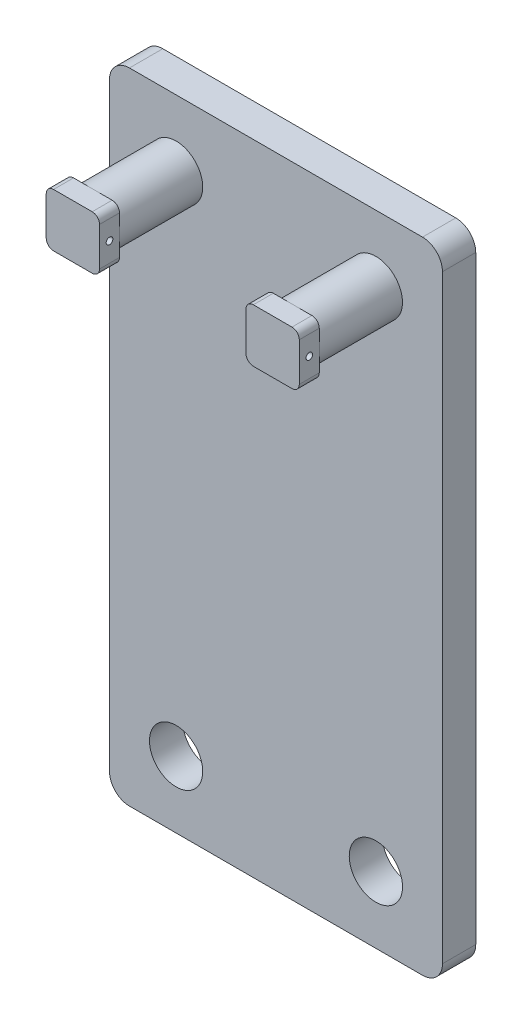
from build123d import *

# Parameters (mm, degrees)
BOSS_EXTRUDE1_DEPTH = 50
FILLET1_R           = 30
FILLET2_R           = 30
FILLET3_R           = 30
FILLET4_R           = 30
SKETCH6_R           = 40
CUT_EXTRUDE3_DEPTH  = 75
SKETCH7_R           = 40
BOSS_EXTRUDE4_DEPTH = 125
SKETCH8_W           = 80
SKETCH8_H           = 80
BOSS_EXTRUDE5_DEPTH = 30
SKETCH9_R           = 5
CUT_EXTRUDE4_DEPTH  = 80
FILLET13_R          = 11
FILLET14_R          = 11
FILLET15_R          = 11
FILLET16_R          = 11
FILLET17_R          = 11
FILLET18_R          = 11
FILLET19_R          = 11
FILLET20_R          = 11


with BuildPart() as part:
    # Sketch1 → Boss-Extrude1 (new body)
    with BuildSketch(Plane.XY):
        Polygon((250, 55.311649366), (-250, 55.311649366), (-250, -44.688350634), (-250, -264.688350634), (-250, -584.688350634), (-250, -804.688350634), (-250, -904.688350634), (250, -904.688350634), (250, -804.688350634), (250, -584.688350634), (250, -264.688350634), (250, -44.688350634), align=None)
    extrude(amount=BOSS_EXTRUDE1_DEPTH)

    # Fillet1
    fillet1_edges = [part.edges().sort_by_distance(p)[0] for p in [
        (-250, 55.311649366, 25),
    ]]
    fillet(fillet1_edges, radius=FILLET1_R)

    # Fillet2
    fillet2_edges = [part.edges().sort_by_distance(p)[0] for p in [
        (250, 55.311649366, 25),
    ]]
    fillet(fillet2_edges, radius=FILLET2_R)

    # Fillet3
    fillet3_edges = [part.edges().sort_by_distance(p)[0] for p in [
        (-250, -904.688350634, 25),
    ]]
    fillet(fillet3_edges, radius=FILLET3_R)

    # Fillet4
    fillet4_edges = [part.edges().sort_by_distance(p)[0] for p in [
        (250, -904.688350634, 25),
    ]]
    fillet(fillet4_edges, radius=FILLET4_R)

    # Sketch6 → Cut-Extrude3 (cut)
    with BuildSketch(Plane.XY.offset(50)):
        with Locations((-150, -804.688350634)):
            Circle(SKETCH6_R)
        with Locations((150, -804.688350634)):
            Circle(SKETCH6_R)
    extrude(amount=-CUT_EXTRUDE3_DEPTH, mode=Mode.SUBTRACT)

    # Sketch7 → Boss-Extrude4 (add)
    with BuildSketch(Plane.XY.offset(50)):
        with Locations(Location((150, -44.688350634, 0), (0, 0, 180))):
            Circle(SKETCH7_R)
        with Locations(Location((-150, -44.688350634, 0), (0, 0, 180))):
            Circle(SKETCH7_R)
    extrude(amount=BOSS_EXTRUDE4_DEPTH)

    # Sketch8 → Boss-Extrude5 (add)
    with BuildSketch(Plane.XY.offset(175)):
        with Locations((-150, -44.688350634)):
            Rectangle(SKETCH8_W, SKETCH8_H)
    boss_extrude5 = extrude(amount=BOSS_EXTRUDE5_DEPTH)

    # Sketch9 → Cut-Extrude4 (cut)
    with BuildSketch(Plane.ZY.offset(190)):
        with Locations((190, -44.688350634)):
            Circle(SKETCH9_R)
    cut_extrude4 = extrude(amount=-CUT_EXTRUDE4_DEPTH, mode=Mode.SUBTRACT)

    # Mirror2: Boss-Extrude5, Cut-Extrude4 across plane
    add(boss_extrude5.mirror(Plane(origin=(0, 0, 0), x_dir=(0, 0, 1), z_dir=(1, 0, 0))))
    add(cut_extrude4.mirror(Plane(origin=(0, 0, 0), x_dir=(0, 0, 1), z_dir=(1, 0, 0))), mode=Mode.SUBTRACT)

    # Fillet13
    fillet13_edges = [part.edges().sort_by_distance(p)[0] for p in [
        (-190, -4.688350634, 190),
    ]]
    fillet(fillet13_edges, radius=FILLET13_R)

    # Fillet14
    fillet14_edges = [part.edges().sort_by_distance(p)[0] for p in [
        (-110, -4.688350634, 190),
    ]]
    fillet(fillet14_edges, radius=FILLET14_R)

    # Fillet15
    fillet15_edges = [part.edges().sort_by_distance(p)[0] for p in [
        (-110, -84.688350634, 190),
    ]]
    fillet(fillet15_edges, radius=FILLET15_R)

    # Fillet16
    fillet16_edges = [part.edges().sort_by_distance(p)[0] for p in [
        (-190, -84.688350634, 190),
    ]]
    fillet(fillet16_edges, radius=FILLET16_R)

    # Fillet17
    fillet17_edges = [part.edges().sort_by_distance(p)[0] for p in [
        (110, -4.688350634, 190),
    ]]
    fillet(fillet17_edges, radius=FILLET17_R)

    # Fillet18
    fillet18_edges = [part.edges().sort_by_distance(p)[0] for p in [
        (110, -84.688350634, 190),
    ]]
    fillet(fillet18_edges, radius=FILLET18_R)

    # Fillet19
    fillet19_edges = [part.edges().sort_by_distance(p)[0] for p in [
        (190, -84.688350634, 190),
    ]]
    fillet(fillet19_edges, radius=FILLET19_R)

    # Fillet20
    fillet20_edges = [part.edges().sort_by_distance(p)[0] for p in [
        (190, -4.688350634, 190),
    ]]
    fillet(fillet20_edges, radius=FILLET20_R)


solid = part.part
